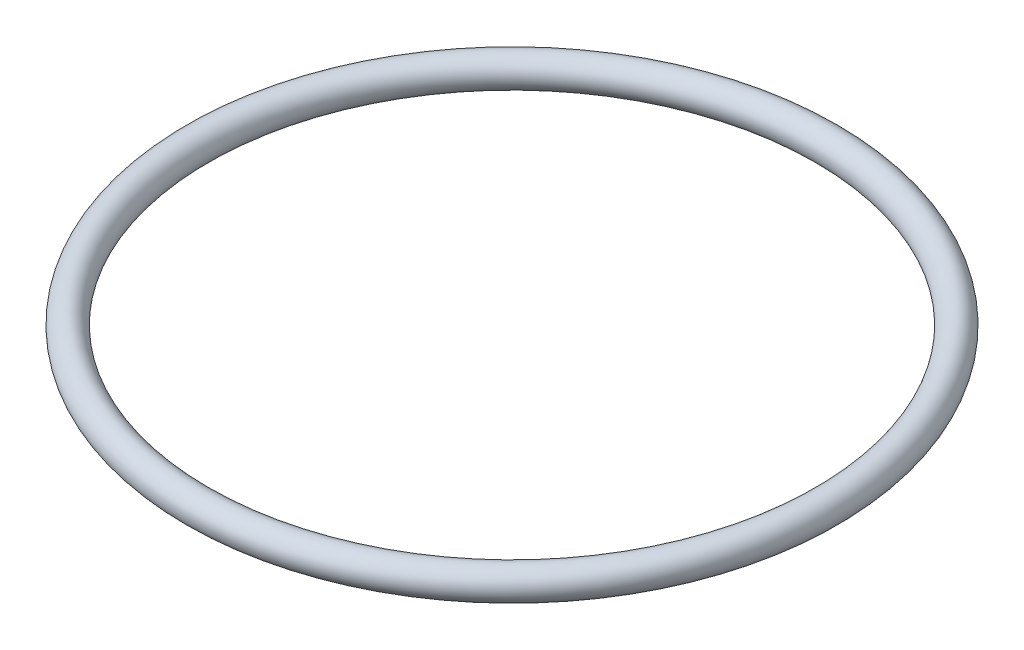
ISO-10303-21;
HEADER;
FILE_DESCRIPTION(('STEP AP214'),'2;1');
FILE_NAME('part.step','',(''),(''),'','','');
FILE_SCHEMA(('AUTOMOTIVE_DESIGN { 1 0 10303 214 1 1 1 1 }'));
ENDSEC;
DATA;
#1=APPLICATION_CONTEXT('core data for automotive mechanical design processes');
#2=APPLICATION_PROTOCOL_DEFINITION('international standard','automotive_design',2000,#1);
#3=PRODUCT_CONTEXT('',#1,'mechanical');
#4=PRODUCT('Part','Part','',(#3));
#5=PRODUCT_RELATED_PRODUCT_CATEGORY('part','',(#4));
#6=PRODUCT_DEFINITION_FORMATION('','',#4);
#7=PRODUCT_DEFINITION_CONTEXT('part definition',#1,'design');
#8=PRODUCT_DEFINITION('design','',#6,#7);
#9=PRODUCT_DEFINITION_SHAPE('','',#8);
#10=(LENGTH_UNIT() NAMED_UNIT(*) SI_UNIT(.MILLI.,.METRE.));
#11=(NAMED_UNIT(*) PLANE_ANGLE_UNIT() SI_UNIT($,.RADIAN.));
#12=(NAMED_UNIT(*) SI_UNIT($,.STERADIAN.) SOLID_ANGLE_UNIT());
#13=UNCERTAINTY_MEASURE_WITH_UNIT(LENGTH_MEASURE(1.E-05),#10,'distance_accuracy_value','');
#14=(GEOMETRIC_REPRESENTATION_CONTEXT(3) GLOBAL_UNCERTAINTY_ASSIGNED_CONTEXT((#13)) GLOBAL_UNIT_ASSIGNED_CONTEXT((#10,
#11,#12)) REPRESENTATION_CONTEXT('',''));
#15=CARTESIAN_POINT('',(0.,0.,0.));
#16=DIRECTION('',(0.,0.,1.));
#17=DIRECTION('',(1.,0.,0.));
#18=AXIS2_PLACEMENT_3D('',#15,#16,#17);
#19=CARTESIAN_POINT('',(0.,0.,0.));
#20=DIRECTION('',(0.,1.,0.));
#21=DIRECTION('',(0.,0.,1.));
#22=AXIS2_PLACEMENT_3D('',#19,#20,#21);
#23=TOROIDAL_SURFACE('',#22,18.2118,0.889);
#24=CARTESIAN_POINT('',(0.,0.,19.1008));
#25=VERTEX_POINT('',#24);
#26=VERTEX_LOOP('',#25);
#27=FACE_BOUND('',#26,.T.);
#28=ADVANCED_FACE('F35',(#27),#23,.T.);
#29=CLOSED_SHELL('',(#28));
#30=MANIFOLD_SOLID_BREP('B2',#29);
#31=ADVANCED_BREP_SHAPE_REPRESENTATION('',(#18,#30),#14);
#32=SHAPE_DEFINITION_REPRESENTATION(#9,#31);
ENDSEC;
END-ISO-10303-21;
